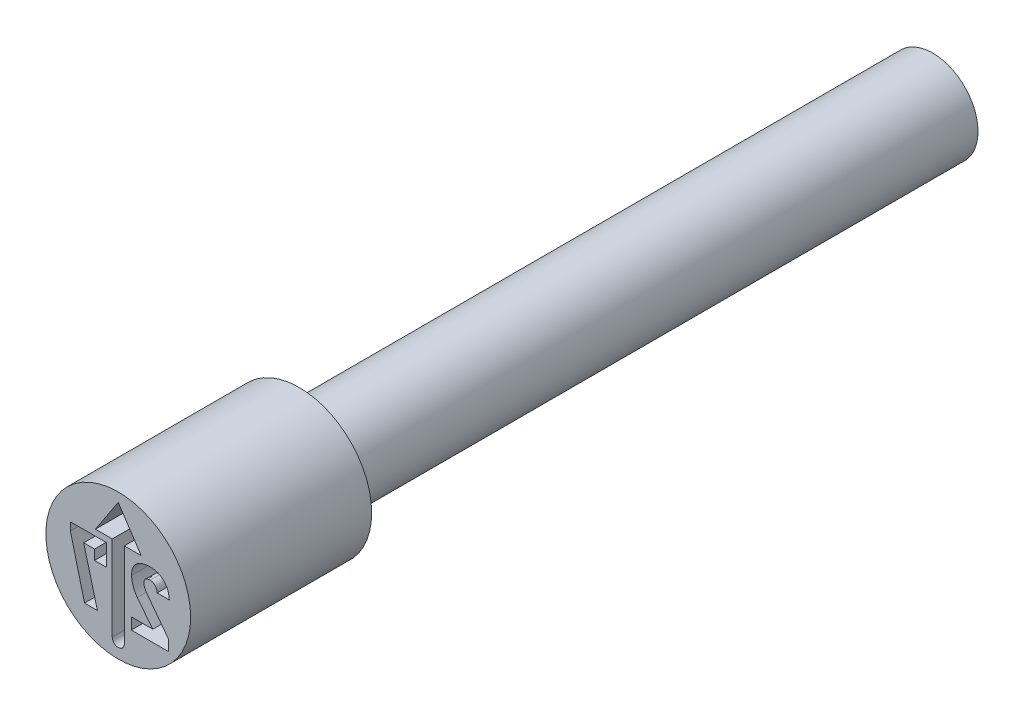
from build123d import *

# Parameters (mm, degrees)
CUT_EXTRUDE4_DEPTH = 0.3
CUT_EXTRUDE5_DEPTH = 0.3


with BuildPart() as part:
    # Sketch2 → Revolve1 (revolve)
    with BuildSketch(Plane(origin=(0, 0, 0), x_dir=(0, 0, -1), z_dir=(1, 0, 0)), mode=Mode.PRIVATE) as revolve1_sk:
        Polygon((0, 0.8), (0, 0), (9, 0), (9, 0.5), (2, 0.5), (2, 0.8), align=None)
    revolve(revolve1_sk.sketch.rotate(Axis((0, 0, -0.403888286), (0, 0, -1)), 90), axis=Axis((0, 0, -0.403888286), (0, 0, -1)))

    # Sketch3 → Cut-Extrude4 (cut)
    with BuildSketch(Plane.XY):
        with BuildLine():
            Line((0.066665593, 0.317223), (0.066665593, -0.621656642))
            ThreePointArc((0.066665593, -0.621656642), (0, -0.688322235), (-0.066665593, -0.621656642))
            Line((-0.066665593, -0.621656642), (-0.066665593, 0.317223))
            Line((-0.066665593, 0.317223), (-0.252671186, 0.317223))
            Line((-0.252671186, 0.317223), (0, 0.700740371))
            Line((0, 0.700740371), (0.252671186, 0.317223))
            Line((0.252671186, 0.317223), (0.066665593, 0.317223))
        make_face()
    extrude(amount=-CUT_EXTRUDE4_DEPTH, mode=Mode.SUBTRACT)

    # Sketch4 → Cut-Extrude5 (cut)
    with BuildSketch(Plane.XY):
        with BuildLine():
            Line((0.555757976, -0.45), (0.555757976, -0.330965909))
            Line((0.555757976, -0.330965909), (0.31655343, -0.0140625))
            add(Edge.make_bspline(
                [(0.31655343, -0.0140625), (0.311543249, -0.007002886), (0.301781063, 0.006752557), (0.292945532, 0.02564287), (0.287441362, 0.04045311), (0.284818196, 0.051193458), (0.28294691, 0.061440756), (0.282716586, 0.068174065), (0.282604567, 0.071448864)],
                knots=[0, 0, 0, 0, 1.664252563, 3.24274559, 3.998498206, 4.704056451, 5.369707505, 6, 6, 6, 6], degree=3))
            add(Edge.make_bspline(
                [(0.282604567, 0.071448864), (0.282798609, 0.076918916), (0.283170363, 0.08549371), (0.286672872, 0.097575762), (0.292413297, 0.108097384), (0.30063497, 0.11678821), (0.310870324, 0.123662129), (0.323117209, 0.12850645), (0.337215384, 0.131284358), (0.347222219, 0.13163406), (0.35249093, 0.131818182)],
                knots=[0, 0, 0, 0, 1.029992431, 1.973301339, 2.872554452, 3.768620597, 4.704316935, 5.693697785, 6.785705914, 8, 8, 8, 8], degree=3))
            add(Edge.make_bspline(
                [(0.35249093, 0.131818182), (0.357636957, 0.131617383), (0.367635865, 0.131227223), (0.381791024, 0.126903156), (0.394546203, 0.120120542), (0.40554218, 0.110442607), (0.414647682, 0.098291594), (0.422037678, 0.083982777), (0.427056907, 0.067257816), (0.428832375, 0.055285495), (0.429763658, 0.049005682)],
                knots=[0, 0, 0, 0, 0.980828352, 1.905783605, 2.800718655, 3.724477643, 4.680224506, 5.688112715, 6.78735127, 8, 8, 8, 8], degree=3))
            Line((0.429763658, 0.049005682), (0.564422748, 0.048579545))
            add(Edge.make_bspline(
                [(0.564422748, 0.048579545), (0.56375829, 0.057119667), (0.56246128, 0.072957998), (0.55820912, 0.095868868), (0.55271337, 0.11744934), (0.545722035, 0.13769513), (0.536738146, 0.156371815), (0.526644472, 0.173869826), (0.514504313, 0.189647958), (0.501215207, 0.204234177), (0.48641352, 0.217081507), (0.470630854, 0.228414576), (0.453628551, 0.237845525), (0.435665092, 0.245669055), (0.416541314, 0.251606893), (0.396507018, 0.256054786), (0.375332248, 0.258619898), (0.360878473, 0.258931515), (0.353485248, 0.259090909)],
                knots=[0, 0, 0, 0, 1.173229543, 2.290119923, 3.354877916, 4.382703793, 5.372196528, 6.339367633, 7.289741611, 8.236749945, 9.180232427, 10.11040526, 11.033485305, 11.978374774, 12.930610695, 13.916256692, 14.93414813, 16, 16, 16, 16], degree=3))
            add(Edge.make_bspline(
                [(0.353485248, 0.259090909), (0.345524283, 0.258977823), (0.330041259, 0.258757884), (0.307500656, 0.25638372), (0.286292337, 0.252800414), (0.266450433, 0.247558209), (0.248054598, 0.240720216), (0.231049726, 0.232475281), (0.215400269, 0.222753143), (0.201226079, 0.211533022), (0.18847281, 0.199018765), (0.177495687, 0.185083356), (0.167993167, 0.170008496), (0.160565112, 0.153501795), (0.15444974, 0.135951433), (0.150490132, 0.117042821), (0.147821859, 0.096998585), (0.14752783, 0.083200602), (0.147377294, 0.076136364)],
                knots=[0, 0, 0, 0, 1.219700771, 2.37215663, 3.469774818, 4.513610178, 5.512457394, 6.473141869, 7.405450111, 8.330272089, 9.238546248, 10.1372905, 11.043445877, 11.962355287, 12.905558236, 13.886315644, 14.917844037, 16, 16, 16, 16], degree=3))
            add(Edge.make_bspline(
                [(0.147377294, 0.076136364), (0.147558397, 0.067603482), (0.147920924, 0.05166001), (0.151193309, 0.027798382), (0.156466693, 0.004058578), (0.163708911, -0.019444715), (0.1727056, -0.042304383), (0.183503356, -0.064207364), (0.195690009, -0.085163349), (0.20534683, -0.098097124), (0.210161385, -0.104545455)],
                knots=[0, 0, 0, 0, 0.984368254, 1.970475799, 2.971844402, 3.988480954, 5.008197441, 6.005725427, 7.005724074, 8, 8, 8, 8], degree=3))
            Line((0.210161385, -0.104545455), (0.381752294, -0.322727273))
            Line((0.381752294, -0.322727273), (0.143542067, -0.322727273))
            Line((0.143542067, -0.322727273), (0.143542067, -0.45))
            Line((0.143542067, -0.45), (0.555757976, -0.45))
        make_face()
        Polygon((-0.528963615, 0.25), (-0.528963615, 0.162215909), (-0.372713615, -0.45), (-0.23038407, -0.45), (-0.381804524, 0.122727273), (-0.262060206, 0.122727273), (-0.262060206, 0.013636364), (-0.130668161, 0.013636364), (-0.130668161, 0.25), align=None)
    extrude(amount=-CUT_EXTRUDE5_DEPTH, mode=Mode.SUBTRACT)


solid = part.part
